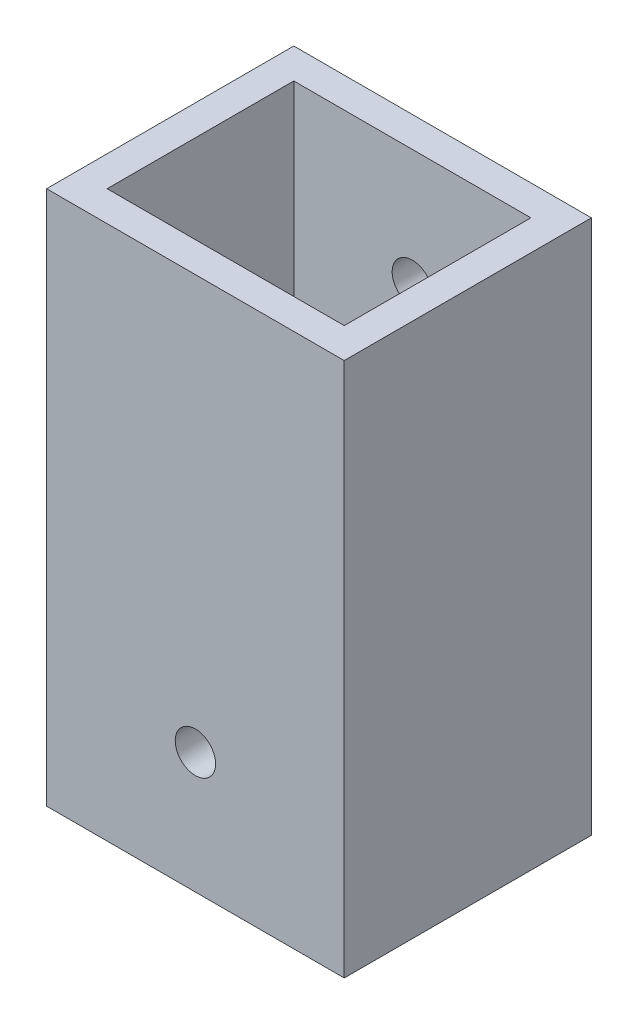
from build123d import *

# Parameters (mm, degrees)
SKETCH1_W           = 29.5
SKETCH1_H           = 24.5
SKETCH1_W_2         = 23.5
SKETCH1_H_2         = 18.5
BOSS_EXTRUDE1_DEPTH = 50
SKETCH2_R           = 2
CUT_EXTRUDE1_DEPTH  = 14.92
SKETCH3_W           = 29.5
SKETCH3_H           = 24.5
BOSS_EXTRUDE2_DEPTH = 3
SKETCH4_R           = 2
CUT_EXTRUDE2_DEPTH  = 28


with BuildPart() as part:
    # Sketch1 → Boss-Extrude1 (new body)
    with BuildSketch(Plane(origin=(0, 0, 0), x_dir=(1, 0, 0), z_dir=(0, 1, 0))):
        Rectangle(SKETCH1_W, SKETCH1_H)
        Rectangle(SKETCH1_W_2, SKETCH1_H_2, mode=Mode.SUBTRACT)
    extrude(amount=BOSS_EXTRUDE1_DEPTH)

    # Sketch2 → Cut-Extrude1 (cut)
    with BuildSketch(Plane(origin=(0, 0, -12.25), x_dir=(-1, 0, 0), z_dir=(0, 0, -1))):
        with Locations((0, 38.5)):
            Circle(SKETCH2_R)
    extrude(amount=-CUT_EXTRUDE1_DEPTH, mode=Mode.SUBTRACT)

    # Sketch3 → Boss-Extrude2 (add)
    with BuildSketch(Plane.XZ):
        Rectangle(SKETCH3_W, SKETCH3_H)
    extrude(amount=BOSS_EXTRUDE2_DEPTH)

    # Sketch4 → Cut-Extrude2 (cut)
    with BuildSketch(Plane(origin=(0, 0, -12.25), x_dir=(-1, 0, 0), z_dir=(0, 0, -1))):
        with Locations((0, 9)):
            Circle(SKETCH4_R)
    extrude(amount=-CUT_EXTRUDE2_DEPTH, mode=Mode.SUBTRACT)


solid = part.part
